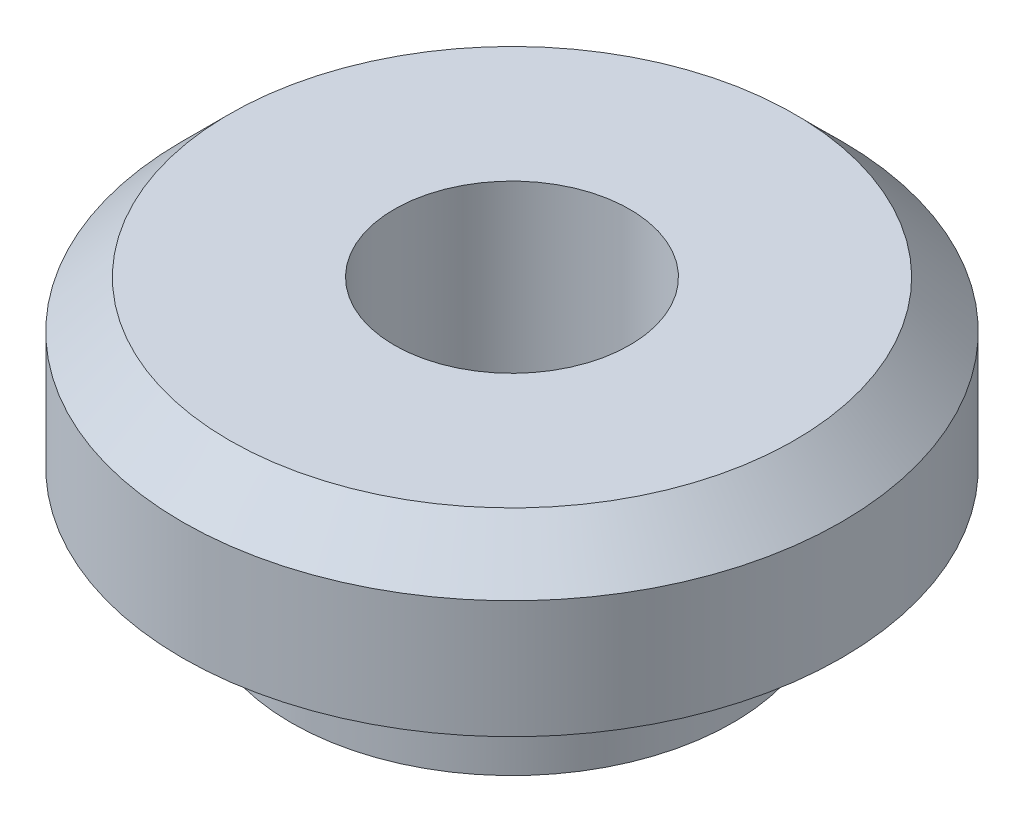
from build123d import *


with BuildPart() as part:
    # Sketch1 → Boss-Revolve1 (revolve)
    with BuildSketch(Plane(origin=(0, 0, 0), x_dir=(0, 0, -1), z_dir=(1, 0, 0))):
        Polygon((-1.27, 1.778), (-1.27, -1.1938), (-2.38125, -1.1938), (-2.38125, 0), (-3.556, 0), (-3.556, 1.27), (-3.048, 1.778), align=None)
    revolve(axis=Axis((0, 40, 0), (0, -1, 0)))


solid = part.part
